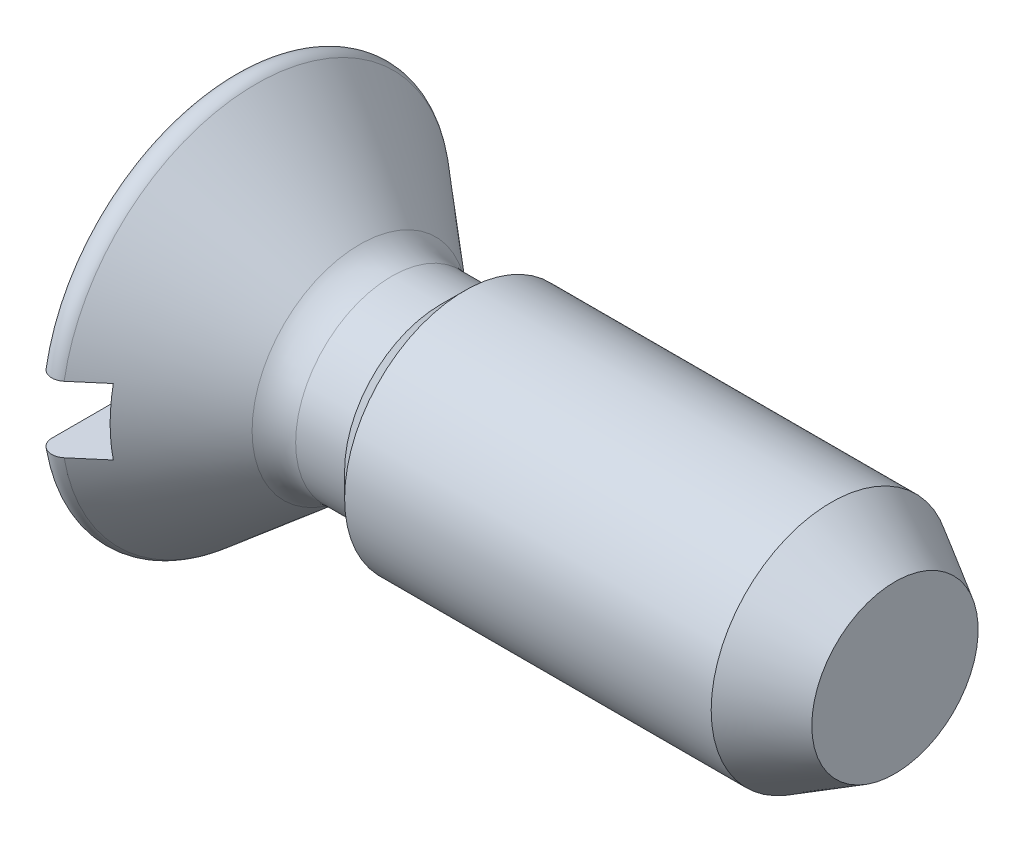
ISO-10303-21;
HEADER;
FILE_DESCRIPTION(('STEP AP214'),'2;1');
FILE_NAME('part.step','',(''),(''),'','','');
FILE_SCHEMA(('AUTOMOTIVE_DESIGN { 1 0 10303 214 1 1 1 1 }'));
ENDSEC;
DATA;
#1=APPLICATION_CONTEXT('core data for automotive mechanical design processes');
#2=APPLICATION_PROTOCOL_DEFINITION('international standard','automotive_design',2000,#1);
#3=PRODUCT_CONTEXT('',#1,'mechanical');
#4=PRODUCT('Part','Part','',(#3));
#5=PRODUCT_RELATED_PRODUCT_CATEGORY('part','',(#4));
#6=PRODUCT_DEFINITION_FORMATION('','',#4);
#7=PRODUCT_DEFINITION_CONTEXT('part definition',#1,'design');
#8=PRODUCT_DEFINITION('design','',#6,#7);
#9=PRODUCT_DEFINITION_SHAPE('','',#8);
#10=(LENGTH_UNIT() NAMED_UNIT(*) SI_UNIT(.MILLI.,.METRE.));
#11=(NAMED_UNIT(*) PLANE_ANGLE_UNIT() SI_UNIT($,.RADIAN.));
#12=(NAMED_UNIT(*) SI_UNIT($,.STERADIAN.) SOLID_ANGLE_UNIT());
#13=UNCERTAINTY_MEASURE_WITH_UNIT(LENGTH_MEASURE(1.E-05),#10,'distance_accuracy_value','');
#14=(GEOMETRIC_REPRESENTATION_CONTEXT(3) GLOBAL_UNCERTAINTY_ASSIGNED_CONTEXT((#13)) GLOBAL_UNIT_ASSIGNED_CONTEXT((#10,
#11,#12)) REPRESENTATION_CONTEXT('',''));
#15=CARTESIAN_POINT('',(0.,0.,0.));
#16=DIRECTION('',(0.,0.,1.));
#17=DIRECTION('',(1.,0.,0.));
#18=AXIS2_PLACEMENT_3D('',#15,#16,#17);
#19=CARTESIAN_POINT('',(0.,0.,0.));
#20=DIRECTION('',(-1.,0.,0.));
#21=DIRECTION('',(0.,0.,1.));
#22=AXIS2_PLACEMENT_3D('',#19,#20,#21);
#23=CYLINDRICAL_SURFACE('',#22,1.45);
#24=CARTESIAN_POINT('',(2.8,0.,0.));
#25=DIRECTION('',(-1.,0.,0.));
#26=DIRECTION('',(0.,0.,1.));
#27=AXIS2_PLACEMENT_3D('',#24,#25,#26);
#28=CIRCLE('',#27,1.45);
#29=CARTESIAN_POINT('',(2.8,0.,1.45));
#30=VERTEX_POINT('',#29);
#31=EDGE_CURVE('E221',#30,#30,#28,.T.);
#32=ORIENTED_EDGE('',*,*,#31,.F.);
#33=EDGE_LOOP('',(#32));
#34=FACE_BOUND('',#33,.T.);
#35=CARTESIAN_POINT('',(7.22923739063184,0.,0.));
#36=DIRECTION('',(-1.,0.,0.));
#37=DIRECTION('',(0.,0.,1.));
#38=AXIS2_PLACEMENT_3D('',#35,#36,#37);
#39=CIRCLE('',#38,1.45);
#40=CARTESIAN_POINT('',(7.22923739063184,0.,1.45));
#41=VERTEX_POINT('',#40);
#42=EDGE_CURVE('E347',#41,#41,#39,.T.);
#43=ORIENTED_EDGE('',*,*,#42,.T.);
#44=EDGE_LOOP('',(#43));
#45=FACE_BOUND('',#44,.T.);
#46=ADVANCED_FACE('F76',(#34,#45),#23,.T.);
#47=CARTESIAN_POINT('',(0.17,0.,0.));
#48=DIRECTION('',(-1.,0.,0.));
#49=DIRECTION('',(0.,0.,1.));
#50=AXIS2_PLACEMENT_3D('',#47,#48,#49);
#51=TOROIDAL_SURFACE('',#50,2.22190319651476,0.17);
#52=CARTESIAN_POINT('',(0.279273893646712,0.,0.));
#53=DIRECTION('',(-1.,0.,0.));
#54=DIRECTION('',(0.,0.,1.));
#55=AXIS2_PLACEMENT_3D('',#52,#53,#54);
#56=CIRCLE('',#55,2.35213075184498);
#57=CARTESIAN_POINT('',(0.279273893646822,0.4,2.31786951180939));
#58=VERTEX_POINT('',#57);
#59=CARTESIAN_POINT('',(0.279273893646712,0.4,-2.31786951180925));
#60=VERTEX_POINT('',#59);
#61=EDGE_CURVE('E209',#58,#60,#56,.T.);
#62=ORIENTED_EDGE('',*,*,#61,.T.);
#63=CARTESIAN_POINT('',(0.0889384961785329,0.4,-2.33735245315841));
#64=CARTESIAN_POINT('',(0.0805263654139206,0.4,-2.33272221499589));
#65=CARTESIAN_POINT('',(0.072502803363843,0.4,-2.32737032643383));
#66=CARTESIAN_POINT('',(0.0574658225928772,0.4,-2.31538584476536));
#67=CARTESIAN_POINT('',(0.0504537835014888,0.4,-2.30875153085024));
#68=CARTESIAN_POINT('',(0.0376460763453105,0.4,-2.29441026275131));
#69=CARTESIAN_POINT('',(0.0318490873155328,0.4,-2.28670448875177));
#70=CARTESIAN_POINT('',(0.0216166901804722,0.4,-2.27044028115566));
#71=CARTESIAN_POINT('',(0.0171809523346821,0.4,-2.26188205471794));
#72=CARTESIAN_POINT('',(0.00974088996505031,0.4,-2.24405535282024));
#73=CARTESIAN_POINT('',(0.00675261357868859,0.4,-2.23478018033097));
#74=CARTESIAN_POINT('',(0.00235416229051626,0.4,-2.21586245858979));
#75=CARTESIAN_POINT('',(0.000944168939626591,0.4,-2.20621986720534));
#76=CARTESIAN_POINT('',(-0.000271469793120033,0.4,-2.18671389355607));
#77=CARTESIAN_POINT('',(-5.7032249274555E-05,0.4,-2.17684925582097));
#78=CARTESIAN_POINT('',(0.00201640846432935,0.4,-2.15729406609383));
#79=CARTESIAN_POINT('',(0.00387548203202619,0.4,-2.14760352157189));
#80=CARTESIAN_POINT('',(0.00920170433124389,0.4,-2.12862529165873));
#81=CARTESIAN_POINT('',(0.0126763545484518,0.4,-2.11933970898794));
#82=CARTESIAN_POINT('',(0.0211446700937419,0.4,-2.10148865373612));
#83=CARTESIAN_POINT('',(0.0261383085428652,0.4,-2.09292316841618));
#84=CARTESIAN_POINT('',(0.0374749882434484,0.4,-2.07681720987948));
#85=CARTESIAN_POINT('',(0.0438093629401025,0.4,-2.06927064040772));
#86=CARTESIAN_POINT('',(0.0576733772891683,0.4,-2.05536898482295));
#87=CARTESIAN_POINT('',(0.0652029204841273,0.4,-2.04901380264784));
#88=CARTESIAN_POINT('',(0.0811188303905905,0.4,-2.03778408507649));
#89=CARTESIAN_POINT('',(0.0894899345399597,0.4,-2.03288792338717));
#90=CARTESIAN_POINT('',(0.106946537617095,0.4,-2.02460018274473));
#91=CARTESIAN_POINT('',(0.116031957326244,0.4,-2.02120843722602));
#92=CARTESIAN_POINT('',(0.134484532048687,0.4,-2.01608678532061));
#93=CARTESIAN_POINT('',(0.143843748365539,0.4,-2.01432825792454));
#94=CARTESIAN_POINT('',(0.162724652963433,0.4,-2.01242635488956));
#95=CARTESIAN_POINT('',(0.172246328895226,0.4,-2.01228285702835));
#96=CARTESIAN_POINT('',(0.191073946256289,0.4,-2.01360825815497));
#97=CARTESIAN_POINT('',(0.200381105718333,0.4,-2.01505994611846));
#98=CARTESIAN_POINT('',(0.218620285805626,0.4,-2.01950203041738));
#99=CARTESIAN_POINT('',(0.227552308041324,0.4,-2.02249242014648));
#100=CARTESIAN_POINT('',(0.244812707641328,0.4,-2.02992704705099));
#101=CARTESIAN_POINT('',(0.253139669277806,0.4,-2.03437456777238));
#102=CARTESIAN_POINT('',(0.268942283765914,0.4,-2.04458633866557));
#103=CARTESIAN_POINT('',(0.276417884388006,0.4,-2.05035066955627));
#104=CARTESIAN_POINT('',(0.290417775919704,0.4,-2.06311463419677));
#105=CARTESIAN_POINT('',(0.296927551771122,0.4,-2.0701301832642));
#106=CARTESIAN_POINT('',(0.308702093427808,0.4,-2.0851378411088));
#107=CARTESIAN_POINT('',(0.313966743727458,0.4,-2.09313004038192));
#108=CARTESIAN_POINT('',(0.323200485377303,0.4,-2.11001835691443));
#109=CARTESIAN_POINT('',(0.327144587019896,0.4,-2.11892814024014));
#110=CARTESIAN_POINT('',(0.333503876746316,0.4,-2.13727765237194));
#111=CARTESIAN_POINT('',(0.335918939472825,0.4,-2.1467174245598));
#112=CARTESIAN_POINT('',(0.339180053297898,0.4,-2.1659961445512));
#113=CARTESIAN_POINT('',(0.340004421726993,0.4,-2.17583876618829));
#114=CARTESIAN_POINT('',(0.339995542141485,0.4,-2.19552353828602));
#115=CARTESIAN_POINT('',(0.339162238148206,0.4,-2.20536568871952));
#116=CARTESIAN_POINT('',(0.33585124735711,0.4,-2.22480511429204));
#117=CARTESIAN_POINT('',(0.333367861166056,0.4,-2.234401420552));
#118=CARTESIAN_POINT('',(0.326813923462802,0.4,-2.25303623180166));
#119=CARTESIAN_POINT('',(0.322743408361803,0.4,-2.26207474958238));
#120=CARTESIAN_POINT('',(0.313157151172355,0.4,-2.27926625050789));
#121=CARTESIAN_POINT('',(0.307651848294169,0.4,-2.28742505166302));
#122=CARTESIAN_POINT('',(0.295331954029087,0.4,-2.30268608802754));
#123=CARTESIAN_POINT('',(0.288517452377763,0.4,-2.30978839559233));
#124=CARTESIAN_POINT('',(0.273871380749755,0.4,-2.32263037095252));
#125=CARTESIAN_POINT('',(0.266054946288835,0.4,-2.32838729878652));
#126=CARTESIAN_POINT('',(0.249555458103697,0.4,-2.33848453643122));
#127=CARTESIAN_POINT('',(0.240872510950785,0.4,-2.34282502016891));
#128=CARTESIAN_POINT('',(0.223020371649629,0.4,-2.34990283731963));
#129=CARTESIAN_POINT('',(0.213859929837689,0.4,-2.35266225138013));
#130=CARTESIAN_POINT('',(0.195201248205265,0.4,-2.35658830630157));
#131=CARTESIAN_POINT('',(0.185702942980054,0.4,-2.35775463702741));
#132=CARTESIAN_POINT('',(0.166731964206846,0.4,-2.3584543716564));
#133=CARTESIAN_POINT('',(0.157259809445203,0.4,-2.35800215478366));
#134=CARTESIAN_POINT('',(0.138535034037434,0.4,-2.35551039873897));
#135=CARTESIAN_POINT('',(0.129282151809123,0.4,-2.35347286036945));
#136=CARTESIAN_POINT('',(0.114841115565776,0.4,-2.34899264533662));
#137=CARTESIAN_POINT('',(0.109498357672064,0.4,-2.34703240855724));
#138=CARTESIAN_POINT('',(0.099037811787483,0.4,-2.34258328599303));
#139=CARTESIAN_POINT('',(0.0939200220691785,0.4,-2.34009440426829));
#140=CARTESIAN_POINT('',(0.0889384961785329,0.4,-2.33735245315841));
#141=B_SPLINE_CURVE_WITH_KNOTS('',3,(#63,#64,#65,#66,#67,#68,#69,#70,#71,#72,#73,#74,#75,#76,
#77,#78,#79,#80,#81,#82,#83,#84,#85,#86,#87,#88,#89,#90,#91,#92,#93,#94,#95,#96,#97,#98,#99,
#100,#101,#102,#103,#104,#105,#106,#107,#108,#109,#110,#111,#112,#113,#114,#115,#116,#117,#118,
#119,#120,#121,#122,#123,#124,#125,#126,#127,#128,#129,#130,#131,#132,#133,#134,#135,#136,#137,
#138,#139,#140),.UNSPECIFIED.,.T.,.F.,(4,2,2,2,2,2,2,2,2,2,2,2,2,2,2,2,2,2,2,2,2,2,2,2,2,2,2,2,
2,2,2,2,2,2,2,2,2,2,4),(0.,0.0287856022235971,0.0576101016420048,0.08640309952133,
0.115189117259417,0.144287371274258,0.173388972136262,0.202850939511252,0.23231416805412,
0.261915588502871,0.291516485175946,0.320931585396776,0.350344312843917,0.379296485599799,
0.408245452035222,0.436676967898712,0.465106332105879,0.493231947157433,0.521357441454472,
0.549546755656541,0.577737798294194,0.606316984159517,0.634898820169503,0.663994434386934,
0.693092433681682,0.722584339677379,0.75207724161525,0.781672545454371,0.811267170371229,
0.840652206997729,0.870035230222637,0.899017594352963,0.927996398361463,0.956559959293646,
0.985129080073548,1.01344502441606,1.04172528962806,1.05877178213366,1.07581814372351),.UNSPECIFIED.);
#142=CARTESIAN_POINT('',(0.,0.4,-2.18560147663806));
#143=VERTEX_POINT('',#142);
#144=EDGE_CURVE('E99',#60,#143,#141,.T.);
#145=ORIENTED_EDGE('',*,*,#144,.T.);
#146=CARTESIAN_POINT('',(0.,0.,0.));
#147=DIRECTION('',(-1.,0.,0.));
#148=DIRECTION('',(0.,0.,1.));
#149=AXIS2_PLACEMENT_3D('',#146,#147,#148);
#150=CIRCLE('',#149,2.22190319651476);
#151=CARTESIAN_POINT('',(0.,0.4,2.18560147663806));
#152=VERTEX_POINT('',#151);
#153=EDGE_CURVE('E205',#152,#143,#150,.T.);
#154=ORIENTED_EDGE('',*,*,#153,.F.);
#155=CARTESIAN_POINT('',(0.0607268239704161,0.4,2.05307195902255));
#156=CARTESIAN_POINT('',(0.0533325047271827,0.4,2.05939372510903));
#157=CARTESIAN_POINT('',(0.0464730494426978,0.4,2.06635324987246));
#158=CARTESIAN_POINT('',(0.0340187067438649,0.4,2.08133495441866));
#159=CARTESIAN_POINT('',(0.0284256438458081,0.4,2.08935864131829));
#160=CARTESIAN_POINT('',(0.018665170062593,0.4,2.10621894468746));
#161=CARTESIAN_POINT('',(0.0144961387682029,0.4,2.11505462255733));
#162=CARTESIAN_POINT('',(0.00768431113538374,0.4,2.13329240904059));
#163=CARTESIAN_POINT('',(0.00504111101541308,0.4,2.14269436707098));
#164=CARTESIAN_POINT('',(0.00132719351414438,0.4,2.16190667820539));
#165=CARTESIAN_POINT('',(0.000273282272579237,0.4,2.17172028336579));
#166=CARTESIAN_POINT('',(-0.000180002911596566,0.4,2.19138640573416));
#167=CARTESIAN_POINT('',(0.000420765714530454,0.4,2.20123892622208));
#168=CARTESIAN_POINT('',(0.00327010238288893,0.4,2.22074609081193));
#169=CARTESIAN_POINT('',(0.00552566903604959,0.4,2.23039971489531));
#170=CARTESIAN_POINT('',(0.0116358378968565,0.4,2.24918728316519));
#171=CARTESIAN_POINT('',(0.0154904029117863,0.4,2.25832123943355));
#172=CARTESIAN_POINT('',(0.0246673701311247,0.4,2.27574471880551));
#173=CARTESIAN_POINT('',(0.0299801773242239,0.4,2.2840392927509));
#174=CARTESIAN_POINT('',(0.0419406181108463,0.4,2.29960299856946));
#175=CARTESIAN_POINT('',(0.0485881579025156,0.4,2.30687220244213));
#176=CARTESIAN_POINT('',(0.0629350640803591,0.4,2.32007373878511));
#177=CARTESIAN_POINT('',(0.070619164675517,0.4,2.32602265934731));
#178=CARTESIAN_POINT('',(0.0868890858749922,0.4,2.33652365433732));
#179=CARTESIAN_POINT('',(0.0954748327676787,0.4,2.34107584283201));
#180=CARTESIAN_POINT('',(0.113171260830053,0.4,2.34858661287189));
#181=CARTESIAN_POINT('',(0.12227261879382,0.4,2.3515671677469));
#182=CARTESIAN_POINT('',(0.140848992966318,0.4,2.35594091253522));
#183=CARTESIAN_POINT('',(0.150323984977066,0.4,2.35733420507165));
#184=CARTESIAN_POINT('',(0.16927897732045,0.4,2.35848440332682));
#185=CARTESIAN_POINT('',(0.178758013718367,0.4,2.35825725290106));
#186=CARTESIAN_POINT('',(0.197542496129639,0.4,2.3562113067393));
#187=CARTESIAN_POINT('',(0.206847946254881,0.4,2.3543925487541));
#188=CARTESIAN_POINT('',(0.22500396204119,0.4,2.34922405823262));
#189=CARTESIAN_POINT('',(0.233855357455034,0.4,2.34587723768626));
#190=CARTESIAN_POINT('',(0.250875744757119,0.4,2.33775442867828));
#191=CARTESIAN_POINT('',(0.259044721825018,0.4,2.33297840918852));
#192=CARTESIAN_POINT('',(0.274528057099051,0.4,2.32210279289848));
#193=CARTESIAN_POINT('',(0.281836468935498,0.4,2.31599473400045));
#194=CARTESIAN_POINT('',(0.295340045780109,0.4,2.30265233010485));
#195=CARTESIAN_POINT('',(0.301535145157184,0.4,2.29541791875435));
#196=CARTESIAN_POINT('',(0.3127217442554,0.4,2.27993063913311));
#197=CARTESIAN_POINT('',(0.317696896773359,0.4,2.27166596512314));
#198=CARTESIAN_POINT('',(0.326211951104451,0.4,2.25442781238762));
#199=CARTESIAN_POINT('',(0.329751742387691,0.4,2.24545427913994));
#200=CARTESIAN_POINT('',(0.335348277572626,0.4,2.22691398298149));
#201=CARTESIAN_POINT('',(0.337382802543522,0.4,2.21734051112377));
#202=CARTESIAN_POINT('',(0.33983431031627,0.4,2.19798854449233));
#203=CARTESIAN_POINT('',(0.340251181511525,0.4,2.18821003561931));
#204=CARTESIAN_POINT('',(0.339454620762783,0.4,2.16861591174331));
#205=CARTESIAN_POINT('',(0.33822394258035,0.4,2.15880099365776));
#206=CARTESIAN_POINT('',(0.334135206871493,0.4,2.13951581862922));
#207=CARTESIAN_POINT('',(0.331277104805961,0.4,2.13004557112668));
#208=CARTESIAN_POINT('',(0.324003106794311,0.4,2.1117066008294));
#209=CARTESIAN_POINT('',(0.319584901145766,0.4,2.1028387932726));
#210=CARTESIAN_POINT('',(0.309308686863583,0.4,2.08598024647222));
#211=CARTESIAN_POINT('',(0.30345072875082,0.4,2.07798947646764));
#212=CARTESIAN_POINT('',(0.290516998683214,0.4,2.06319820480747));
#213=CARTESIAN_POINT('',(0.28345346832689,0.4,2.05638700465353));
#214=CARTESIAN_POINT('',(0.268265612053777,0.4,2.04407240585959));
#215=CARTESIAN_POINT('',(0.260141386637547,0.4,2.03856888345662));
#216=CARTESIAN_POINT('',(0.243212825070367,0.4,2.02912837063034));
#217=CARTESIAN_POINT('',(0.234422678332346,0.4,2.0251659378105));
#218=CARTESIAN_POINT('',(0.216294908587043,0.4,2.01880174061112));
#219=CARTESIAN_POINT('',(0.206957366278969,0.4,2.01639974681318));
#220=CARTESIAN_POINT('',(0.188167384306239,0.4,2.01326137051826));
#221=CARTESIAN_POINT('',(0.178719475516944,0.4,2.01249781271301));
#222=CARTESIAN_POINT('',(0.159828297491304,0.4,2.01258012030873));
#223=CARTESIAN_POINT('',(0.150385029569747,0.4,2.01342630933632));
#224=CARTESIAN_POINT('',(0.131839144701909,0.4,2.01668990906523));
#225=CARTESIAN_POINT('',(0.122734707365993,0.4,2.01909703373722));
#226=CARTESIAN_POINT('',(0.105063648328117,0.4,2.02539558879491));
#227=CARTESIAN_POINT('',(0.0964963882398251,0.4,2.02928521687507));
#228=CARTESIAN_POINT('',(0.083413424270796,0.4,2.03658971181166));
#229=CARTESIAN_POINT('',(0.0786498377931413,0.4,2.03957028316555));
#230=CARTESIAN_POINT('',(0.0694403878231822,0.4,2.04598707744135));
#231=CARTESIAN_POINT('',(0.0649945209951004,0.4,2.04942329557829));
#232=CARTESIAN_POINT('',(0.0607268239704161,0.4,2.05307195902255));
#233=B_SPLINE_CURVE_WITH_KNOTS('',3,(#155,#156,#157,#158,#159,#160,#161,#162,#163,#164,#165,
#166,#167,#168,#169,#170,#171,#172,#173,#174,#175,#176,#177,#178,#179,#180,#181,#182,#183,#184,
#185,#186,#187,#188,#189,#190,#191,#192,#193,#194,#195,#196,#197,#198,#199,#200,#201,#202,#203,
#204,#205,#206,#207,#208,#209,#210,#211,#212,#213,#214,#215,#216,#217,#218,#219,#220,#221,#222,
#223,#224,#225,#226,#227,#228,#229,#230,#231,#232),.UNSPECIFIED.,.T.,.F.,(4,2,2,2,2,2,2,2,2,2,2,
2,2,2,2,2,2,2,2,2,2,2,2,2,2,2,2,2,2,2,2,2,2,2,2,2,2,2,4),(0.,0.0291641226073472,
0.0583699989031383,0.0875425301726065,0.116707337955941,0.146178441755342,0.175652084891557,
0.205251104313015,0.234849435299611,0.264257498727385,0.293663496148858,0.322675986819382,
0.351686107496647,0.380279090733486,0.408870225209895,0.437180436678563,0.465489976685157,
0.49374579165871,0.522002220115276,0.550443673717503,0.578886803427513,0.607692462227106,
0.636500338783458,0.66572539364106,0.694952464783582,0.724487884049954,0.754024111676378,
0.783604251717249,0.813183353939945,0.842478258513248,0.871770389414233,0.900556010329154,
0.929337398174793,0.957637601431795,0.985943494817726,1.01406473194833,1.04215189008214,
1.05898439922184,1.075816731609),.UNSPECIFIED.);
#234=EDGE_CURVE('E148',#152,#58,#233,.T.);
#235=ORIENTED_EDGE('',*,*,#234,.T.);
#236=EDGE_LOOP('',(#62,#145,#154,#235));
#237=FACE_BOUND('',#236,.T.);
#238=ADVANCED_FACE('F233',(#237),#51,.T.);
#239=CARTESIAN_POINT('',(0.,0.,0.));
#240=DIRECTION('',(1.,0.,0.));
#241=DIRECTION('',(0.,0.,-1.));
#242=AXIS2_PLACEMENT_3D('',#239,#240,#241);
#243=PLANE('',#242);
#244=ORIENTED_EDGE('',*,*,#153,.T.);
#245=DIRECTION('',(0.,0.,1.));
#246=VECTOR('',#245,1.);
#247=CARTESIAN_POINT('',(0.,0.4,0.));
#248=LINE('',#247,#246);
#249=EDGE_CURVE('E225',#143,#152,#248,.T.);
#250=ORIENTED_EDGE('',*,*,#249,.T.);
#251=EDGE_LOOP('',(#244,#250));
#252=FACE_BOUND('',#251,.T.);
#253=ADVANCED_FACE('F238',(#252),#243,.F.);
#254=CARTESIAN_POINT('',(2.8,0.,0.));
#255=DIRECTION('',(1.,0.,0.));
#256=DIRECTION('',(0.,0.,-1.));
#257=AXIS2_PLACEMENT_3D('',#254,#255,#256);
#258=CONICAL_SURFACE('',#257,1.45,0.785398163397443);
#259=CARTESIAN_POINT('',(2.51,0.,0.));
#260=DIRECTION('',(-1.,0.,0.));
#261=DIRECTION('',(0.,0.,1.));
#262=AXIS2_PLACEMENT_3D('',#259,#260,#261);
#263=CIRCLE('',#262,1.16);
#264=CARTESIAN_POINT('',(2.51,0.,1.16));
#265=VERTEX_POINT('',#264);
#266=EDGE_CURVE('E218',#265,#265,#263,.T.);
#267=ORIENTED_EDGE('',*,*,#266,.F.);
#268=EDGE_LOOP('',(#267));
#269=FACE_BOUND('',#268,.T.);
#270=ORIENTED_EDGE('',*,*,#31,.T.);
#271=EDGE_LOOP('',(#270));
#272=FACE_BOUND('',#271,.T.);
#273=ADVANCED_FACE('F250',(#269,#272),#258,.T.);
#274=CARTESIAN_POINT('',(0.,0.,0.));
#275=DIRECTION('',(-1.,0.,0.));
#276=DIRECTION('',(0.,0.,1.));
#277=AXIS2_PLACEMENT_3D('',#274,#275,#276);
#278=CYLINDRICAL_SURFACE('',#277,1.16);
#279=CARTESIAN_POINT('',(1.91838214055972,0.,0.));
#280=DIRECTION('',(-1.,0.,0.));
#281=DIRECTION('',(0.,0.,1.));
#282=AXIS2_PLACEMENT_3D('',#279,#280,#281);
#283=CIRCLE('',#282,1.16);
#284=CARTESIAN_POINT('',(1.91838214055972,0.,1.16));
#285=VERTEX_POINT('',#284);
#286=EDGE_CURVE('E215',#285,#285,#283,.T.);
#287=ORIENTED_EDGE('',*,*,#286,.F.);
#288=EDGE_LOOP('',(#287));
#289=FACE_BOUND('',#288,.T.);
#290=ORIENTED_EDGE('',*,*,#266,.T.);
#291=EDGE_LOOP('',(#290));
#292=FACE_BOUND('',#291,.T.);
#293=ADVANCED_FACE('F253',(#289,#292),#278,.T.);
#294=CARTESIAN_POINT('',(1.91838214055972,0.,0.));
#295=DIRECTION('',(-1.,0.,0.));
#296=DIRECTION('',(0.,0.,1.));
#297=AXIS2_PLACEMENT_3D('',#294,#295,#296);
#298=TOROIDAL_SURFACE('',#297,1.76,0.6);
#299=CARTESIAN_POINT('',(1.5327095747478,0.,0.));
#300=DIRECTION('',(-1.,0.,0.));
#301=DIRECTION('',(0.,0.,1.));
#302=AXIS2_PLACEMENT_3D('',#299,#300,#301);
#303=CIRCLE('',#302,1.30037333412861);
#304=CARTESIAN_POINT('',(1.5327095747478,0.,1.30037333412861));
#305=VERTEX_POINT('',#304);
#306=EDGE_CURVE('E212',#305,#305,#303,.T.);
#307=ORIENTED_EDGE('',*,*,#306,.F.);
#308=EDGE_LOOP('',(#307));
#309=FACE_BOUND('',#308,.T.);
#310=ORIENTED_EDGE('',*,*,#286,.T.);
#311=EDGE_LOOP('',(#310));
#312=FACE_BOUND('',#311,.T.);
#313=ADVANCED_FACE('F239',(#309,#312),#298,.F.);
#314=CARTESIAN_POINT('',(1.5327095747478,0.,0.));
#315=DIRECTION('',(-1.,0.,0.));
#316=DIRECTION('',(0.,0.,1.));
#317=AXIS2_PLACEMENT_3D('',#314,#315,#316);
#318=CONICAL_SURFACE('',#317,1.30037333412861,0.698131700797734);
#319=CARTESIAN_POINT('',(0.6,0.,0.));
#320=DIRECTION('',(1.,0.,0.));
#321=DIRECTION('',(0.,0.,-1.));
#322=AXIS2_PLACEMENT_3D('',#319,#320,#321);
#323=CIRCLE('',#322,2.08300959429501);
#324=CARTESIAN_POINT('',(0.6,-0.4,-2.04424288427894));
#325=VERTEX_POINT('',#324);
#326=CARTESIAN_POINT('',(0.6,0.4,-2.04424288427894));
#327=VERTEX_POINT('',#326);
#328=EDGE_CURVE('E49',#325,#327,#323,.T.);
#329=ORIENTED_EDGE('',*,*,#328,.T.);
#330=CARTESIAN_POINT('',(-2.55003532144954,0.4,4.7092457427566));
#331=CARTESIAN_POINT('',(-2.36866257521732,0.4,4.5565043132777));
#332=CARTESIAN_POINT('',(-2.18731269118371,0.4,4.40373570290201));
#333=CARTESIAN_POINT('',(-1.82468195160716,0.4,4.09811033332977));
#334=CARTESIAN_POINT('',(-1.64340109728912,0.4,3.94525357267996));
#335=CARTESIAN_POINT('',(-1.28082171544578,0.4,3.63932528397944));
#336=CARTESIAN_POINT('',(-1.09952325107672,0.4,3.48625368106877));
#337=CARTESIAN_POINT('',(-0.737074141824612,0.4,3.17994146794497));
#338=CARTESIAN_POINT('',(-0.555923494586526,0.4,3.02670086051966));
#339=CARTESIAN_POINT('',(-0.189959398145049,0.4,2.71665911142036));
#340=CARTESIAN_POINT('',(-0.00515084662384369,0.4,2.55985218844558));
#341=CARTESIAN_POINT('',(0.364085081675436,0.4,2.24577137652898));
#342=CARTESIAN_POINT('',(0.548512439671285,0.4,2.08849746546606));
#343=CARTESIAN_POINT('',(0.824542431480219,0.4,1.85195640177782));
#344=CARTESIAN_POINT('',(0.916430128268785,0.4,1.7730220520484));
#345=CARTESIAN_POINT('',(1.09992081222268,0.4,1.61482330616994));
#346=CARTESIAN_POINT('',(1.19152380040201,0.4,1.53555891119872));
#347=CARTESIAN_POINT('',(1.3742794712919,0.4,1.3765269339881));
#348=CARTESIAN_POINT('',(1.46543218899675,0.4,1.29675939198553));
#349=CARTESIAN_POINT('',(1.6470030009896,0.4,1.13639386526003));
#350=CARTESIAN_POINT('',(1.73742111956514,0.4,1.05579590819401));
#351=CARTESIAN_POINT('',(1.87608053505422,0.4,0.930016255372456));
#352=CARTESIAN_POINT('',(1.92481780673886,0.4,0.885382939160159));
#353=CARTESIAN_POINT('',(2.02165860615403,0.4,0.795391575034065));
#354=CARTESIAN_POINT('',(2.06976185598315,0.4,0.750033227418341));
#355=CARTESIAN_POINT('',(2.16493799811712,0.4,0.658198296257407));
#356=CARTESIAN_POINT('',(2.21201048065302,0.4,0.611721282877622));
#357=CARTESIAN_POINT('',(2.28114976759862,0.4,0.540600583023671));
#358=CARTESIAN_POINT('',(2.30394335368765,0.4,0.51666834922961));
#359=CARTESIAN_POINT('',(2.34882117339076,0.4,0.468150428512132));
#360=CARTESIAN_POINT('',(2.37090540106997,0.4,0.443564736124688));
#361=CARTESIAN_POINT('',(2.42240662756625,0.4,0.383816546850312));
#362=CARTESIAN_POINT('',(2.45135989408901,0.4,0.348237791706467));
#363=CARTESIAN_POINT('',(2.49190782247,0.4,0.292809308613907));
#364=CARTESIAN_POINT('',(2.50492952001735,0.4,0.274013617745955));
#365=CARTESIAN_POINT('',(2.52956992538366,0.4,0.235532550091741));
#366=CARTESIAN_POINT('',(2.54118993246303,0.4,0.215848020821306));
#367=CARTESIAN_POINT('',(2.56227212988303,0.4,0.175577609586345));
#368=CARTESIAN_POINT('',(2.57175475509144,0.4,0.155002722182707));
#369=CARTESIAN_POINT('',(2.5877391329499,0.4,0.112722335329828));
#370=CARTESIAN_POINT('',(2.59424657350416,0.4,0.0910190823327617));
#371=CARTESIAN_POINT('',(2.6032585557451,0.4,0.0463845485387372));
#372=CARTESIAN_POINT('',(2.60569842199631,0.4,0.0234393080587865));
#373=CARTESIAN_POINT('',(2.60576628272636,0.4,-0.022431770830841));
#374=CARTESIAN_POINT('',(2.6033991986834,0.4,-0.0453576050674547));
#375=CARTESIAN_POINT('',(2.59390530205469,0.4,-0.0930674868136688));
#376=CARTESIAN_POINT('',(2.58623358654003,0.4,-0.11773750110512));
#377=CARTESIAN_POINT('',(2.57196135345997,0.4,-0.153629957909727));
#378=CARTESIAN_POINT('',(2.56672423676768,0.4,-0.165440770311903));
#379=CARTESIAN_POINT('',(2.55550186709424,0.4,-0.188700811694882));
#380=CARTESIAN_POINT('',(2.54951679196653,0.4,-0.200150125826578));
#381=CARTESIAN_POINT('',(2.53108467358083,0.4,-0.233254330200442));
#382=CARTESIAN_POINT('',(2.51782350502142,0.4,-0.254452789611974));
#383=CARTESIAN_POINT('',(2.48984173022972,0.4,-0.295872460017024));
#384=CARTESIAN_POINT('',(2.47511946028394,0.4,-0.316092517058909));
#385=CARTESIAN_POINT('',(2.42940407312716,0.4,-0.375766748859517));
#386=CARTESIAN_POINT('',(2.39695105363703,0.4,-0.414092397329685));
#387=CARTESIAN_POINT('',(2.32979796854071,0.4,-0.48933768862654));
#388=CARTESIAN_POINT('',(2.29507894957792,0.4,-0.526239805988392));
#389=CARTESIAN_POINT('',(2.22456791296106,0.4,-0.598834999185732));
#390=CARTESIAN_POINT('',(2.18877858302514,0.4,-0.634530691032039));
#391=CARTESIAN_POINT('',(2.11724700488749,0.4,-0.704436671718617));
#392=CARTESIAN_POINT('',(2.08151972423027,0.4,-0.738662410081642));
#393=CARTESIAN_POINT('',(2.00959655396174,0.4,-0.806618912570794));
#394=CARTESIAN_POINT('',(1.97340065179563,0.4,-0.840349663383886));
#395=CARTESIAN_POINT('',(1.86431577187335,0.4,-0.941023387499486));
#396=CARTESIAN_POINT('',(1.7909400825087,0.4,-1.00743779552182));
#397=CARTESIAN_POINT('',(1.64339029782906,0.4,-1.13955245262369));
#398=CARTESIAN_POINT('',(1.56921533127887,0.4,-1.20525172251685));
#399=CARTESIAN_POINT('',(1.42042618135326,0.4,-1.33613828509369));
#400=CARTESIAN_POINT('',(1.34581203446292,0.4,-1.40132561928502));
#401=CARTESIAN_POINT('',(1.12295313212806,0.4,-1.59516793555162));
#402=CARTESIAN_POINT('',(0.974291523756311,0.4,-1.72334293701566));
#403=CARTESIAN_POINT('',(0.676484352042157,0.4,-1.97898426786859));
#404=CARTESIAN_POINT('',(0.527339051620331,0.4,-2.10645090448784));
#405=CARTESIAN_POINT('',(0.136342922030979,0.4,-2.43976405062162));
#406=CARTESIAN_POINT('',(-0.105767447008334,0.4,-2.64530601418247));
#407=CARTESIAN_POINT('',(-0.590430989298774,0.4,-3.05595827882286));
#408=CARTESIAN_POINT('',(-0.832984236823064,0.4,-3.26106849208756));
#409=CARTESIAN_POINT('',(-1.32122757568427,0.4,-3.67347534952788));
#410=CARTESIAN_POINT('',(-1.56692042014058,0.4,-3.88076873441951));
#411=CARTESIAN_POINT('',(-2.05840937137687,0.4,-4.29513674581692));
#412=CARTESIAN_POINT('',(-2.30420544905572,0.4,-4.50221140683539));
#413=CARTESIAN_POINT('',(-2.55003532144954,0.4,-4.70924574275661));
#414=B_SPLINE_CURVE_WITH_KNOTS('',3,(#330,#331,#332,#333,#334,#335,#336,#337,#338,#339,#340,
#341,#342,#343,#344,#345,#346,#347,#348,#349,#350,#351,#352,#353,#354,#355,#356,#357,#358,#359,
#360,#361,#362,#363,#364,#365,#366,#367,#368,#369,#370,#371,#372,#373,#374,#375,#376,#377,#378,
#379,#380,#381,#382,#383,#384,#385,#386,#387,#388,#389,#390,#391,#392,#393,#394,#395,#396,#397,
#398,#399,#400,#401,#402,#403,#404,#405,#406,#407,#408,#409,#410,#411,#412,#413),.UNSPECIFIED.,
.F.,.F.,(4,2,2,2,2,2,2,2,2,2,2,2,2,2,2,2,2,2,2,2,2,2,2,2,2,2,2,2,2,2,2,2,2,2,2,2,2,2,2,2,2,4),
(0.,0.711360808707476,1.42273370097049,2.1345625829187,2.84637989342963,3.57348591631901,
4.30062694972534,4.66403513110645,5.0274420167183,5.39082019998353,5.75418631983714,
5.95244162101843,6.15078110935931,6.34919806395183,6.44833523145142,6.54747322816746,
6.68491641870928,6.75347314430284,6.8219658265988,6.8897729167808,6.95744982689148,
7.02619289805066,7.09486562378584,7.17190735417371,7.21064990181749,7.24938325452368,
7.324295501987,7.39929405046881,7.54979223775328,7.70176989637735,7.85339355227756,
8.00181513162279,8.15024069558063,8.44713530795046,8.74439519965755,9.04163073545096,
9.63049121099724,10.2190724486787,11.1718479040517,12.1248013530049,13.089176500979,
14.0533654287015),.UNSPECIFIED.);
#415=EDGE_CURVE('E204',#327,#60,#414,.T.);
#416=ORIENTED_EDGE('',*,*,#415,.T.);
#417=ORIENTED_EDGE('',*,*,#61,.F.);
#418=CARTESIAN_POINT('',(0.6,0.4,2.04424288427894));
#419=VERTEX_POINT('',#418);
#420=EDGE_CURVE('E151',#58,#419,#414,.T.);
#421=ORIENTED_EDGE('',*,*,#420,.T.);
#422=CARTESIAN_POINT('',(0.6,-0.4,2.04424288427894));
#423=VERTEX_POINT('',#422);
#424=EDGE_CURVE('E80',#419,#423,#323,.T.);
#425=ORIENTED_EDGE('',*,*,#424,.T.);
#426=CARTESIAN_POINT('',(-2.55003532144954,-0.4,-4.7092457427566));
#427=CARTESIAN_POINT('',(-2.36866257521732,-0.4,-4.5565043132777));
#428=CARTESIAN_POINT('',(-2.18731269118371,-0.4,-4.40373570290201));
#429=CARTESIAN_POINT('',(-1.82468195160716,-0.4,-4.09811033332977));
#430=CARTESIAN_POINT('',(-1.64340109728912,-0.4,-3.94525357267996));
#431=CARTESIAN_POINT('',(-1.28082171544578,-0.4,-3.63932528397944));
#432=CARTESIAN_POINT('',(-1.09952325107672,-0.4,-3.48625368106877));
#433=CARTESIAN_POINT('',(-0.737074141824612,-0.4,-3.17994146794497));
#434=CARTESIAN_POINT('',(-0.555923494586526,-0.4,-3.02670086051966));
#435=CARTESIAN_POINT('',(-0.189959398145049,-0.4,-2.71665911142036));
#436=CARTESIAN_POINT('',(-0.00515084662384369,-0.4,-2.55985218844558));
#437=CARTESIAN_POINT('',(0.364085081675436,-0.4,-2.24577137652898));
#438=CARTESIAN_POINT('',(0.548512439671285,-0.4,-2.08849746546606));
#439=CARTESIAN_POINT('',(0.824542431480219,-0.4,-1.85195640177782));
#440=CARTESIAN_POINT('',(0.916430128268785,-0.4,-1.7730220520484));
#441=CARTESIAN_POINT('',(1.09992081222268,-0.4,-1.61482330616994));
#442=CARTESIAN_POINT('',(1.19152380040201,-0.4,-1.53555891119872));
#443=CARTESIAN_POINT('',(1.3742794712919,-0.4,-1.3765269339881));
#444=CARTESIAN_POINT('',(1.46543218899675,-0.4,-1.29675939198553));
#445=CARTESIAN_POINT('',(1.6470030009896,-0.4,-1.13639386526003));
#446=CARTESIAN_POINT('',(1.73742111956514,-0.4,-1.05579590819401));
#447=CARTESIAN_POINT('',(1.87608053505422,-0.4,-0.930016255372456));
#448=CARTESIAN_POINT('',(1.92481780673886,-0.4,-0.885382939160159));
#449=CARTESIAN_POINT('',(2.02165860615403,-0.4,-0.795391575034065));
#450=CARTESIAN_POINT('',(2.06976185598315,-0.4,-0.750033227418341));
#451=CARTESIAN_POINT('',(2.16493799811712,-0.4,-0.658198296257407));
#452=CARTESIAN_POINT('',(2.21201048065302,-0.4,-0.611721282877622));
#453=CARTESIAN_POINT('',(2.28114976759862,-0.4,-0.540600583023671));
#454=CARTESIAN_POINT('',(2.30394335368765,-0.4,-0.51666834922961));
#455=CARTESIAN_POINT('',(2.34882117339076,-0.4,-0.468150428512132));
#456=CARTESIAN_POINT('',(2.37090540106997,-0.4,-0.443564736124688));
#457=CARTESIAN_POINT('',(2.42240662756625,-0.4,-0.383816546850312));
#458=CARTESIAN_POINT('',(2.45135989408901,-0.4,-0.348237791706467));
#459=CARTESIAN_POINT('',(2.49190782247,-0.4,-0.292809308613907));
#460=CARTESIAN_POINT('',(2.50492952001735,-0.4,-0.274013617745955));
#461=CARTESIAN_POINT('',(2.52956992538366,-0.4,-0.235532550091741));
#462=CARTESIAN_POINT('',(2.54118993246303,-0.4,-0.215848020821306));
#463=CARTESIAN_POINT('',(2.56227212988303,-0.4,-0.175577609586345));
#464=CARTESIAN_POINT('',(2.57175475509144,-0.4,-0.155002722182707));
#465=CARTESIAN_POINT('',(2.5877391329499,-0.4,-0.112722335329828));
#466=CARTESIAN_POINT('',(2.59424657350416,-0.4,-0.0910190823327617));
#467=CARTESIAN_POINT('',(2.6032585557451,-0.4,-0.0463845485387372));
#468=CARTESIAN_POINT('',(2.60569842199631,-0.4,-0.0234393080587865));
#469=CARTESIAN_POINT('',(2.60576628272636,-0.4,0.022431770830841));
#470=CARTESIAN_POINT('',(2.6033991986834,-0.4,0.0453576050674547));
#471=CARTESIAN_POINT('',(2.59390530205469,-0.4,0.0930674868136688));
#472=CARTESIAN_POINT('',(2.58623358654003,-0.4,0.11773750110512));
#473=CARTESIAN_POINT('',(2.57196135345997,-0.4,0.153629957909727));
#474=CARTESIAN_POINT('',(2.56672423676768,-0.4,0.165440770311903));
#475=CARTESIAN_POINT('',(2.55550186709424,-0.4,0.188700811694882));
#476=CARTESIAN_POINT('',(2.54951679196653,-0.4,0.200150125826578));
#477=CARTESIAN_POINT('',(2.53108467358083,-0.4,0.233254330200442));
#478=CARTESIAN_POINT('',(2.51782350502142,-0.4,0.254452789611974));
#479=CARTESIAN_POINT('',(2.48984173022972,-0.4,0.295872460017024));
#480=CARTESIAN_POINT('',(2.47511946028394,-0.4,0.316092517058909));
#481=CARTESIAN_POINT('',(2.42940407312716,-0.4,0.375766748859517));
#482=CARTESIAN_POINT('',(2.39695105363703,-0.4,0.414092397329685));
#483=CARTESIAN_POINT('',(2.32979796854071,-0.4,0.48933768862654));
#484=CARTESIAN_POINT('',(2.29507894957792,-0.4,0.526239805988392));
#485=CARTESIAN_POINT('',(2.22456791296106,-0.4,0.598834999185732));
#486=CARTESIAN_POINT('',(2.18877858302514,-0.4,0.634530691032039));
#487=CARTESIAN_POINT('',(2.11724700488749,-0.4,0.704436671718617));
#488=CARTESIAN_POINT('',(2.08151972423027,-0.4,0.738662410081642));
#489=CARTESIAN_POINT('',(2.00959655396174,-0.4,0.806618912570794));
#490=CARTESIAN_POINT('',(1.97340065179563,-0.4,0.840349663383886));
#491=CARTESIAN_POINT('',(1.86431577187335,-0.4,0.941023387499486));
#492=CARTESIAN_POINT('',(1.7909400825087,-0.4,1.00743779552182));
#493=CARTESIAN_POINT('',(1.64339029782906,-0.4,1.13955245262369));
#494=CARTESIAN_POINT('',(1.56921533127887,-0.4,1.20525172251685));
#495=CARTESIAN_POINT('',(1.42042618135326,-0.4,1.33613828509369));
#496=CARTESIAN_POINT('',(1.34581203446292,-0.4,1.40132561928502));
#497=CARTESIAN_POINT('',(1.12295313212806,-0.4,1.59516793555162));
#498=CARTESIAN_POINT('',(0.974291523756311,-0.4,1.72334293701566));
#499=CARTESIAN_POINT('',(0.676484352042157,-0.4,1.97898426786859));
#500=CARTESIAN_POINT('',(0.527339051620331,-0.4,2.10645090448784));
#501=CARTESIAN_POINT('',(0.136342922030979,-0.4,2.43976405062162));
#502=CARTESIAN_POINT('',(-0.105767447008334,-0.4,2.64530601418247));
#503=CARTESIAN_POINT('',(-0.590430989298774,-0.4,3.05595827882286));
#504=CARTESIAN_POINT('',(-0.832984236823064,-0.4,3.26106849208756));
#505=CARTESIAN_POINT('',(-1.32122757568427,-0.4,3.67347534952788));
#506=CARTESIAN_POINT('',(-1.56692042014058,-0.4,3.88076873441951));
#507=CARTESIAN_POINT('',(-2.05840937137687,-0.4,4.29513674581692));
#508=CARTESIAN_POINT('',(-2.30420544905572,-0.4,4.50221140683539));
#509=CARTESIAN_POINT('',(-2.55003532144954,-0.4,4.70924574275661));
#510=B_SPLINE_CURVE_WITH_KNOTS('',3,(#426,#427,#428,#429,#430,#431,#432,#433,#434,#435,#436,
#437,#438,#439,#440,#441,#442,#443,#444,#445,#446,#447,#448,#449,#450,#451,#452,#453,#454,#455,
#456,#457,#458,#459,#460,#461,#462,#463,#464,#465,#466,#467,#468,#469,#470,#471,#472,#473,#474,
#475,#476,#477,#478,#479,#480,#481,#482,#483,#484,#485,#486,#487,#488,#489,#490,#491,#492,#493,
#494,#495,#496,#497,#498,#499,#500,#501,#502,#503,#504,#505,#506,#507,#508,#509),.UNSPECIFIED.,
.F.,.F.,(4,2,2,2,2,2,2,2,2,2,2,2,2,2,2,2,2,2,2,2,2,2,2,2,2,2,2,2,2,2,2,2,2,2,2,2,2,2,2,2,2,4),
(0.,0.711360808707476,1.42273370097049,2.1345625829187,2.84637989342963,3.57348591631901,
4.30062694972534,4.66403513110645,5.0274420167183,5.39082019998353,5.75418631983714,
5.95244162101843,6.15078110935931,6.34919806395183,6.44833523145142,6.54747322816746,
6.68491641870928,6.75347314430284,6.8219658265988,6.8897729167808,6.95744982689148,
7.02619289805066,7.09486562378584,7.17190735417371,7.21064990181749,7.24938325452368,
7.324295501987,7.39929405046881,7.54979223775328,7.70176989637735,7.85339355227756,
8.00181513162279,8.15024069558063,8.44713530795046,8.74439519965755,9.04163073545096,
9.63049121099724,10.2190724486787,11.1718479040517,12.1248013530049,13.089176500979,
14.0533654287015),.UNSPECIFIED.);
#511=CARTESIAN_POINT('',(0.279273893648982,-0.4,2.31786951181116));
#512=VERTEX_POINT('',#511);
#513=EDGE_CURVE('E140',#423,#512,#510,.T.);
#514=ORIENTED_EDGE('',*,*,#513,.T.);
#515=CARTESIAN_POINT('',(0.279273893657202,-0.4,-2.31786951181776));
#516=VERTEX_POINT('',#515);
#517=EDGE_CURVE('E147',#516,#512,#56,.T.);
#518=ORIENTED_EDGE('',*,*,#517,.F.);
#519=EDGE_CURVE('E138',#516,#325,#510,.T.);
#520=ORIENTED_EDGE('',*,*,#519,.T.);
#521=EDGE_LOOP('',(#329,#416,#417,#421,#425,#514,#518,#520));
#522=FACE_BOUND('',#521,.T.);
#523=ORIENTED_EDGE('',*,*,#306,.T.);
#524=EDGE_LOOP('',(#523));
#525=FACE_BOUND('',#524,.T.);
#526=ADVANCED_FACE('F144',(#522,#525),#318,.T.);
#527=CARTESIAN_POINT('',(0.,-0.4,-2.18560147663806));
#528=VERTEX_POINT('',#527);
#529=CARTESIAN_POINT('',(0.,-0.4,2.18560147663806));
#530=VERTEX_POINT('',#529);
#531=EDGE_CURVE('E208',#528,#530,#150,.T.);
#532=ORIENTED_EDGE('',*,*,#531,.F.);
#533=CARTESIAN_POINT('',(0.0889384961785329,-0.4,-2.33735245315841));
#534=CARTESIAN_POINT('',(0.0972123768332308,-0.4,-2.34190561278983));
#535=CARTESIAN_POINT('',(0.105874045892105,-0.4,-2.34576739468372));
#536=CARTESIAN_POINT('',(0.123729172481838,-0.4,-2.35198637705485));
#537=CARTESIAN_POINT('',(0.132923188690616,-0.4,-2.35434196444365));
#538=CARTESIAN_POINT('',(0.151575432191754,-0.4,-2.3574719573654));
#539=CARTESIAN_POINT('',(0.161033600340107,-0.4,-2.35824671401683));
#540=CARTESIAN_POINT('',(0.179942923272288,-0.4,-2.35819158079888));
#541=CARTESIAN_POINT('',(0.189394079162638,-0.4,-2.35736205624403));
#542=CARTESIAN_POINT('',(0.207995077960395,-0.4,-2.35412950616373));
#543=CARTESIAN_POINT('',(0.217145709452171,-0.4,-2.35173101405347));
#544=CARTESIAN_POINT('',(0.234917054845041,-0.4,-2.34543769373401));
#545=CARTESIAN_POINT('',(0.243537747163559,-0.4,-2.34154280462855));
#546=CARTESIAN_POINT('',(0.260043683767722,-0.4,-2.3323547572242));
#547=CARTESIAN_POINT('',(0.267925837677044,-0.4,-2.32705605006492));
#548=CARTESIAN_POINT('',(0.282701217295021,-0.4,-2.3152241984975));
#549=CARTESIAN_POINT('',(0.289594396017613,-0.4,-2.30869099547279));
#550=CARTESIAN_POINT('',(0.302280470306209,-0.4,-2.29449911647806));
#551=CARTESIAN_POINT('',(0.308060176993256,-0.4,-2.28682865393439));
#552=CARTESIAN_POINT('',(0.318271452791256,-0.4,-2.27063774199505));
#553=CARTESIAN_POINT('',(0.322702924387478,-0.4,-2.2621172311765));
#554=CARTESIAN_POINT('',(0.330159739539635,-0.4,-2.24433580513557));
#555=CARTESIAN_POINT('',(0.333163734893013,-0.4,-2.23506593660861));
#556=CARTESIAN_POINT('',(0.337594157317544,-0.4,-2.21615654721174));
#557=CARTESIAN_POINT('',(0.339020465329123,-0.4,-2.20651699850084));
#558=CARTESIAN_POINT('',(0.340269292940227,-0.4,-2.18701423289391));
#559=CARTESIAN_POINT('',(0.340071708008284,-0.4,-2.17714972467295));
#560=CARTESIAN_POINT('',(0.338031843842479,-0.4,-2.1575919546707));
#561=CARTESIAN_POINT('',(0.336189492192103,-0.4,-2.14789870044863));
#562=CARTESIAN_POINT('',(0.330896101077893,-0.4,-2.12891175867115));
#563=CARTESIAN_POINT('',(0.327437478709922,-0.4,-2.11962018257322));
#564=CARTESIAN_POINT('',(0.319000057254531,-0.4,-2.10175444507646));
#565=CARTESIAN_POINT('',(0.314021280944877,-0.4,-2.09318027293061));
#566=CARTESIAN_POINT('',(0.302712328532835,-0.4,-2.07705405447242));
#567=CARTESIAN_POINT('',(0.296390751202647,-0.4,-2.06949598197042));
#568=CARTESIAN_POINT('',(0.282550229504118,-0.4,-2.05556926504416));
#569=CARTESIAN_POINT('',(0.275031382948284,-0.4,-2.04920052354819));
#570=CARTESIAN_POINT('',(0.25913397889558,-0.4,-2.0379420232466));
#571=CARTESIAN_POINT('',(0.250770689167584,-0.4,-2.03303071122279));
#572=CARTESIAN_POINT('',(0.233326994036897,-0.4,-2.02471157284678));
#573=CARTESIAN_POINT('',(0.224246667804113,-0.4,-2.02130358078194));
#574=CARTESIAN_POINT('',(0.205801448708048,-0.4,-2.016149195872));
#575=CARTESIAN_POINT('',(0.196444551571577,-0.4,-2.01437417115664));
#576=CARTESIAN_POINT('',(0.177565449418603,-0.4,-2.01243921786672));
#577=CARTESIAN_POINT('',(0.168043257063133,-0.4,-2.01227916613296));
#578=CARTESIAN_POINT('',(0.149212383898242,-0.4,-2.01357208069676));
#579=CARTESIAN_POINT('',(0.139902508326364,-0.4,-2.01500773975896));
#580=CARTESIAN_POINT('',(0.121655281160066,-0.4,-2.01941855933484));
#581=CARTESIAN_POINT('',(0.112717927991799,-0.4,-2.02239371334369));
#582=CARTESIAN_POINT('',(0.0954450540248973,-0.4,-2.02979882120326));
#583=CARTESIAN_POINT('',(0.0871109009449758,-0.4,-2.03423196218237));
#584=CARTESIAN_POINT('',(0.0712916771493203,-0.4,-2.04441641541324));
#585=CARTESIAN_POINT('',(0.0638066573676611,-0.4,-2.05016780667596));
#586=CARTESIAN_POINT('',(0.04978615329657,-0.4,-2.062907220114));
#587=CARTESIAN_POINT('',(0.0432651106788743,-0.4,-2.06991113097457));
#588=CARTESIAN_POINT('',(0.0314662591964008,-0.4,-2.08489754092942));
#589=CARTESIAN_POINT('',(0.0261885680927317,-0.4,-2.09288013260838));
#590=CARTESIAN_POINT('',(0.0169270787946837,-0.4,-2.10975132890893));
#591=CARTESIAN_POINT('',(0.0129682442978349,-0.4,-2.11865364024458));
#592=CARTESIAN_POINT('',(0.00657838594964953,-0.4,-2.13699074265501));
#593=CARTESIAN_POINT('',(0.00414748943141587,-0.4,-2.14642557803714));
#594=CARTESIAN_POINT('',(0.000853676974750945,-0.4,-2.16569760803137));
#595=CARTESIAN_POINT('',(1.25290389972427E-05,-0.4,-2.17553852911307));
#596=CARTESIAN_POINT('',(-1.22509981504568E-05,-0.4,-2.19522238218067));
#597=CARTESIAN_POINT('',(0.000804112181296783,-0.4,-2.20506531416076));
#598=CARTESIAN_POINT('',(0.0040812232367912,-0.4,-2.22450867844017));
#599=CARTESIAN_POINT('',(0.00654759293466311,-0.4,-2.23410816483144));
#600=CARTESIAN_POINT('',(0.0130690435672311,-0.4,-2.25275472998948));
#601=CARTESIAN_POINT('',(0.0171244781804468,-0.4,-2.26180168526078));
#602=CARTESIAN_POINT('',(0.0266841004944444,-0.4,-2.27901638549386));
#603=CARTESIAN_POINT('',(0.0321786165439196,-0.4,-2.2871895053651));
#604=CARTESIAN_POINT('',(0.0444759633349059,-0.4,-2.30247291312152));
#605=CARTESIAN_POINT('',(0.0512771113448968,-0.4,-2.30958454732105));
#606=CARTESIAN_POINT('',(0.0632768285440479,-0.4,-2.32014427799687));
#607=CARTESIAN_POINT('',(0.068142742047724,-0.4,-2.32397683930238));
#608=CARTESIAN_POINT('',(0.0782631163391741,-0.4,-2.33108934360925));
#609=CARTESIAN_POINT('',(0.0835175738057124,-0.4,-2.3343692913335));
#610=CARTESIAN_POINT('',(0.0889384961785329,-0.4,-2.33735245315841));
#611=B_SPLINE_CURVE_WITH_KNOTS('',3,(#533,#534,#535,#536,#537,#538,#539,#540,#541,#542,#543,
#544,#545,#546,#547,#548,#549,#550,#551,#552,#553,#554,#555,#556,#557,#558,#559,#560,#561,#562,
#563,#564,#565,#566,#567,#568,#569,#570,#571,#572,#573,#574,#575,#576,#577,#578,#579,#580,#581,
#582,#583,#584,#585,#586,#587,#588,#589,#590,#591,#592,#593,#594,#595,#596,#597,#598,#599,#600,
#601,#602,#603,#604,#605,#606,#607,#608,#609,#610),.UNSPECIFIED.,.T.,.F.,(4,2,2,2,2,2,2,2,2,2,2,
2,2,2,2,2,2,2,2,2,2,2,2,2,2,2,2,2,2,2,2,2,2,2,2,2,2,2,4),(0.,0.0283095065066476,
0.0566492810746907,0.0849827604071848,0.113309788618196,0.141555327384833,0.169802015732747,
0.19816206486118,0.226523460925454,0.255202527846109,0.283883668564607,0.312981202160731,
0.34208093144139,0.371541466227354,0.401003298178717,0.430604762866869,0.460205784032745,
0.489622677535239,0.519037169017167,0.547992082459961,0.576943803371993,0.605377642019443,
0.633809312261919,0.661935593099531,0.690061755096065,0.718249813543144,0.746439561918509,
0.775016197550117,0.803595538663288,0.832688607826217,0.861784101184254,0.891275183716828,
0.920766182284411,0.950358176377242,0.979956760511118,1.00936130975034,1.03872824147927,
1.05727636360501,1.07582432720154),.UNSPECIFIED.);
#612=EDGE_CURVE('E91',#528,#516,#611,.T.);
#613=ORIENTED_EDGE('',*,*,#612,.T.);
#614=ORIENTED_EDGE('',*,*,#517,.T.);
#615=CARTESIAN_POINT('',(0.0607268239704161,-0.4,2.05307195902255));
#616=CARTESIAN_POINT('',(0.0679334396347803,-0.4,2.04691176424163));
#617=CARTESIAN_POINT('',(0.0756582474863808,-0.4,2.04134834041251));
#618=CARTESIAN_POINT('',(0.0919355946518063,-0.4,2.03158789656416));
#619=CARTESIAN_POINT('',(0.10048894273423,-0.4,2.02739222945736));
#620=CARTESIAN_POINT('',(0.118183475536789,-0.4,2.02050242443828));
#621=CARTESIAN_POINT('',(0.127324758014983,-0.4,2.01780853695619));
#622=CARTESIAN_POINT('',(0.145929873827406,-0.4,2.01401117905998));
#623=CARTESIAN_POINT('',(0.155393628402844,-0.4,2.0129073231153));
#624=CARTESIAN_POINT('',(0.174282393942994,-0.4,2.01232728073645));
#625=CARTESIAN_POINT('',(0.183706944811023,-0.4,2.01283603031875));
#626=CARTESIAN_POINT('',(0.20233600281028,-0.4,2.01543195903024));
#627=CARTESIAN_POINT('',(0.211540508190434,-0.4,2.01751915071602));
#628=CARTESIAN_POINT('',(0.229453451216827,-0.4,2.02320064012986));
#629=CARTESIAN_POINT('',(0.238162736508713,-0.4,2.02679226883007));
#630=CARTESIAN_POINT('',(0.254863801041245,-0.4,2.0353714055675));
#631=CARTESIAN_POINT('',(0.26285554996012,-0.4,2.04035897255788));
#632=CARTESIAN_POINT('',(0.27799098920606,-0.4,2.05164258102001));
#633=CARTESIAN_POINT('',(0.285124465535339,-0.4,2.05795231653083));
#634=CARTESIAN_POINT('',(0.298253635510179,-0.4,2.07166110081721));
#635=CARTESIAN_POINT('',(0.304249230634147,-0.4,2.07906024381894));
#636=CARTESIAN_POINT('',(0.31504487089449,-0.4,2.09487752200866));
#637=CARTESIAN_POINT('',(0.319821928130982,-0.4,2.10331134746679));
#638=CARTESIAN_POINT('',(0.327917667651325,-0.4,2.12085209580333));
#639=CARTESIAN_POINT('',(0.331236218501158,-0.4,2.12995907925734));
#640=CARTESIAN_POINT('',(0.336370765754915,-0.4,2.14874089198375));
#641=CARTESIAN_POINT('',(0.338162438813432,-0.4,2.15842237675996));
#642=CARTESIAN_POINT('',(0.340107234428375,-0.4,2.17794877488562));
#643=CARTESIAN_POINT('',(0.340260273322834,-0.4,2.18779369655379));
#644=CARTESIAN_POINT('',(0.338917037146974,-0.4,2.20743776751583));
#645=CARTESIAN_POINT('',(0.337409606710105,-0.4,2.21723615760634));
#646=CARTESIAN_POINT('',(0.332764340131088,-0.4,2.23643890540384));
#647=CARTESIAN_POINT('',(0.329626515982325,-0.4,2.24584326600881));
#648=CARTESIAN_POINT('',(0.321818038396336,-0.4,2.26394619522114));
#649=CARTESIAN_POINT('',(0.317153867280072,-0.4,2.2726475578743));
#650=CARTESIAN_POINT('',(0.306413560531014,-0.4,2.28913064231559));
#651=CARTESIAN_POINT('',(0.30033750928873,-0.4,2.29691241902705));
#652=CARTESIAN_POINT('',(0.287024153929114,-0.4,2.31123146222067));
#653=CARTESIAN_POINT('',(0.279802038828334,-0.4,2.31778284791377));
#654=CARTESIAN_POINT('',(0.264346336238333,-0.4,2.32955830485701));
#655=CARTESIAN_POINT('',(0.256112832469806,-0.4,2.33478248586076));
#656=CARTESIAN_POINT('',(0.238998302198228,-0.4,2.34367480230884));
#657=CARTESIAN_POINT('',(0.230128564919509,-0.4,2.34736466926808));
#658=CARTESIAN_POINT('',(0.211891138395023,-0.4,2.35318365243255));
#659=CARTESIAN_POINT('',(0.202523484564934,-0.4,2.35531287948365));
#660=CARTESIAN_POINT('',(0.183669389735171,-0.4,2.35792926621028));
#661=CARTESIAN_POINT('',(0.174185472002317,-0.4,2.35843463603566));
#662=CARTESIAN_POINT('',(0.155268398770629,-0.4,2.35783914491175));
#663=CARTESIAN_POINT('',(0.145835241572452,-0.4,2.35673833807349));
#664=CARTESIAN_POINT('',(0.127324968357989,-0.4,2.35297180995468));
#665=CARTESIAN_POINT('',(0.118246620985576,-0.4,2.35031213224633));
#666=CARTESIAN_POINT('',(0.100662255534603,-0.4,2.34351336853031));
#667=CARTESIAN_POINT('',(0.0921562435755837,-0.4,2.3393742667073));
#668=CARTESIAN_POINT('',(0.0759124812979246,-0.4,2.32971720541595));
#669=CARTESIAN_POINT('',(0.0681785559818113,-0.4,2.32419281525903));
#670=CARTESIAN_POINT('',(0.0537344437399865,-0.4,2.31193786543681));
#671=CARTESIAN_POINT('',(0.0470243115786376,-0.4,2.30520724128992));
#672=CARTESIAN_POINT('',(0.034733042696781,-0.4,2.29064854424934));
#673=CARTESIAN_POINT('',(0.0291659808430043,-0.4,2.28280859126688));
#674=CARTESIAN_POINT('',(0.0194049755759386,-0.4,2.26631619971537));
#675=CARTESIAN_POINT('',(0.0152111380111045,-0.4,2.25766369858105));
#676=CARTESIAN_POINT('',(0.00825157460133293,-0.4,2.23965686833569));
#677=CARTESIAN_POINT('',(0.00550756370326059,-0.4,2.23029414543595));
#678=CARTESIAN_POINT('',(0.00160975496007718,-0.4,2.2112436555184));
#679=CARTESIAN_POINT('',(0.000456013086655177,-0.4,2.20155587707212));
#680=CARTESIAN_POINT('',(-0.000238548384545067,-0.4,2.1820074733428));
#681=CARTESIAN_POINT('',(0.000239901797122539,-0.4,2.17214616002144));
#682=CARTESIAN_POINT('',(0.00283878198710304,-0.4,2.15263933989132));
#683=CARTESIAN_POINT('',(0.00495967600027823,-0.4,2.14299389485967));
#684=CARTESIAN_POINT('',(0.0108000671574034,-0.4,2.1241540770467));
#685=CARTESIAN_POINT('',(0.0145264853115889,-0.4,2.11496185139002));
#686=CARTESIAN_POINT('',(0.0234784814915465,-0.4,2.09734787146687));
#687=CARTESIAN_POINT('',(0.0287022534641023,-0.4,2.08892520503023));
#688=CARTESIAN_POINT('',(0.0384198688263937,-0.4,2.07588993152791));
#689=CARTESIAN_POINT('',(0.0425222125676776,-0.4,2.07098064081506));
#690=CARTESIAN_POINT('',(0.0512468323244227,-0.4,2.06164783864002));
#691=CARTESIAN_POINT('',(0.0558691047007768,-0.4,2.05722432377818));
#692=CARTESIAN_POINT('',(0.0607268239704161,-0.4,2.05307195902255));
#693=B_SPLINE_CURVE_WITH_KNOTS('',3,(#615,#616,#617,#618,#619,#620,#621,#622,#623,#624,#625,
#626,#627,#628,#629,#630,#631,#632,#633,#634,#635,#636,#637,#638,#639,#640,#641,#642,#643,#644,
#645,#646,#647,#648,#649,#650,#651,#652,#653,#654,#655,#656,#657,#658,#659,#660,#661,#662,#663,
#664,#665,#666,#667,#668,#669,#670,#671,#672,#673,#674,#675,#676,#677,#678,#679,#680,#681,#682,
#683,#684,#685,#686,#687,#688,#689,#690,#691,#692),.UNSPECIFIED.,.T.,.F.,(4,2,2,2,2,2,2,2,2,2,2,
2,2,2,2,2,2,2,2,2,2,2,2,2,2,2,2,2,2,2,2,2,2,2,2,2,2,2,4),(0.,0.0284192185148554,
0.056866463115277,0.0853184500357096,0.113763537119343,0.14194369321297,0.170124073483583,
0.19825466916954,0.22638645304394,0.254825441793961,0.283266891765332,0.312210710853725,
0.341157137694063,0.370556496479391,0.39995735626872,0.429556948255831,0.459156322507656,
0.488631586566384,0.518105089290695,0.547216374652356,0.576325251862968,0.605006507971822,
0.633685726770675,0.662042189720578,0.69039769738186,0.718643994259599,0.746890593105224,
0.775270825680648,0.803652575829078,0.832365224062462,0.861080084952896,0.890213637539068,
0.919348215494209,0.948827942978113,0.978316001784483,1.00793246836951,1.03751336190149,
1.0566698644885,1.07582623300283),.UNSPECIFIED.);
#694=EDGE_CURVE('E161',#512,#530,#693,.T.);
#695=ORIENTED_EDGE('',*,*,#694,.T.);
#696=EDGE_LOOP('',(#532,#613,#614,#695));
#697=FACE_BOUND('',#696,.T.);
#698=ADVANCED_FACE('F171',(#697),#51,.T.);
#699=ORIENTED_EDGE('',*,*,#531,.T.);
#700=DIRECTION('',(0.,0.,-1.));
#701=VECTOR('',#700,1.);
#702=CARTESIAN_POINT('',(0.,-0.4,0.));
#703=LINE('',#702,#701);
#704=EDGE_CURVE('E224',#530,#528,#703,.T.);
#705=ORIENTED_EDGE('',*,*,#704,.T.);
#706=EDGE_LOOP('',(#699,#705));
#707=FACE_BOUND('',#706,.T.);
#708=ADVANCED_FACE('F180',(#707),#243,.F.);
#709=CARTESIAN_POINT('',(0.6,0.4,-2.39190319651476));
#710=DIRECTION('',(1.,0.,0.));
#711=DIRECTION('',(0.,0.,-1.));
#712=AXIS2_PLACEMENT_3D('',#709,#710,#711);
#713=PLANE('',#712);
#714=DIRECTION('',(0.,0.,1.));
#715=VECTOR('',#714,1.);
#716=CARTESIAN_POINT('',(0.6,0.4,-2.39190319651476));
#717=LINE('',#716,#715);
#718=EDGE_CURVE('E134',#327,#419,#717,.T.);
#719=ORIENTED_EDGE('',*,*,#718,.F.);
#720=ORIENTED_EDGE('',*,*,#328,.F.);
#721=DIRECTION('',(0.,0.,1.));
#722=VECTOR('',#721,1.);
#723=CARTESIAN_POINT('',(0.6,-0.4,-2.39190319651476));
#724=LINE('',#723,#722);
#725=EDGE_CURVE('E131',#325,#423,#724,.T.);
#726=ORIENTED_EDGE('',*,*,#725,.T.);
#727=ORIENTED_EDGE('',*,*,#424,.F.);
#728=EDGE_LOOP('',(#719,#720,#726,#727));
#729=FACE_BOUND('',#728,.T.);
#730=ADVANCED_FACE('F130',(#729),#713,.F.);
#731=CARTESIAN_POINT('',(0.,0.4,-2.39190319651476));
#732=DIRECTION('',(0.,1.,0.));
#733=DIRECTION('',(0.,0.,1.));
#734=AXIS2_PLACEMENT_3D('',#731,#732,#733);
#735=PLANE('',#734);
#736=ORIENTED_EDGE('',*,*,#718,.T.);
#737=ORIENTED_EDGE('',*,*,#420,.F.);
#738=ORIENTED_EDGE('',*,*,#234,.F.);
#739=ORIENTED_EDGE('',*,*,#249,.F.);
#740=ORIENTED_EDGE('',*,*,#144,.F.);
#741=ORIENTED_EDGE('',*,*,#415,.F.);
#742=EDGE_LOOP('',(#736,#737,#738,#739,#740,#741));
#743=FACE_BOUND('',#742,.T.);
#744=ADVANCED_FACE('F178',(#743),#735,.F.);
#745=CARTESIAN_POINT('',(0.,-0.4,-2.39190319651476));
#746=DIRECTION('',(0.,-1.,0.));
#747=DIRECTION('',(0.,0.,-1.));
#748=AXIS2_PLACEMENT_3D('',#745,#746,#747);
#749=PLANE('',#748);
#750=ORIENTED_EDGE('',*,*,#612,.F.);
#751=ORIENTED_EDGE('',*,*,#704,.F.);
#752=ORIENTED_EDGE('',*,*,#694,.F.);
#753=ORIENTED_EDGE('',*,*,#513,.F.);
#754=ORIENTED_EDGE('',*,*,#725,.F.);
#755=ORIENTED_EDGE('',*,*,#519,.F.);
#756=EDGE_LOOP('',(#750,#751,#752,#753,#754,#755));
#757=FACE_BOUND('',#756,.T.);
#758=ADVANCED_FACE('F137',(#757),#749,.F.);
#759=CARTESIAN_POINT('',(7.22923739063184,0.,0.));
#760=DIRECTION('',(-1.,0.,0.));
#761=DIRECTION('',(0.,0.,1.));
#762=AXIS2_PLACEMENT_3D('',#759,#760,#761);
#763=CONICAL_SURFACE('',#762,1.45,0.523598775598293);
#764=CARTESIAN_POINT('',(8.,0.,0.));
#765=DIRECTION('',(-1.,0.,0.));
#766=DIRECTION('',(0.,0.,1.));
#767=AXIS2_PLACEMENT_3D('',#764,#765,#766);
#768=CIRCLE('',#767,1.005);
#769=CARTESIAN_POINT('',(8.,0.,1.005));
#770=VERTEX_POINT('',#769);
#771=EDGE_CURVE('E141',#770,#770,#768,.T.);
#772=ORIENTED_EDGE('',*,*,#771,.T.);
#773=EDGE_LOOP('',(#772));
#774=FACE_BOUND('',#773,.T.);
#775=ORIENTED_EDGE('',*,*,#42,.F.);
#776=EDGE_LOOP('',(#775));
#777=FACE_BOUND('',#776,.T.);
#778=ADVANCED_FACE('F177',(#774,#777),#763,.T.);
#779=CARTESIAN_POINT('',(8.,1.45,0.));
#780=DIRECTION('',(-1.,0.,0.));
#781=DIRECTION('',(0.,0.,1.));
#782=AXIS2_PLACEMENT_3D('',#779,#780,#781);
#783=PLANE('',#782);
#784=ORIENTED_EDGE('',*,*,#771,.F.);
#785=EDGE_LOOP('',(#784));
#786=FACE_BOUND('',#785,.T.);
#787=ADVANCED_FACE('F78',(#786),#783,.F.);
#788=CLOSED_SHELL('',(#46,#238,#253,#273,#293,#313,#526,#698,#708,#730,#744,#758,#778,#787));
#789=MANIFOLD_SOLID_BREP('B6',#788);
#790=ADVANCED_BREP_SHAPE_REPRESENTATION('',(#18,#789),#14);
#791=SHAPE_DEFINITION_REPRESENTATION(#9,#790);
ENDSEC;
END-ISO-10303-21;
